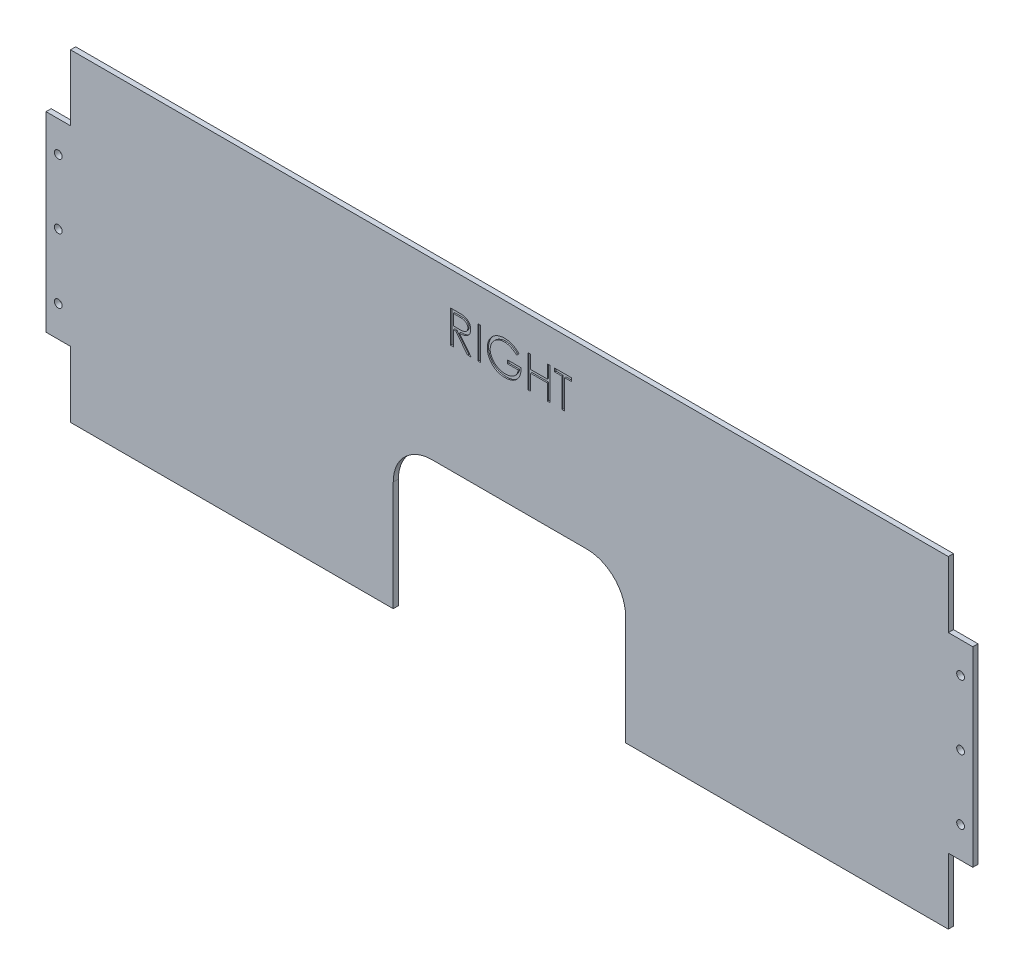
from build123d import *

# Parameters (mm, degrees)
BOSS_EXTRU_1_DEPTH      = 4
ESQUISSE2_R             = 3
ENL_V_MAT_EXTRU_1_DEPTH = 381.160492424
ESQUISSE3_W             = 180
ESQUISSE3_H             = 115
ENL_V_MAT_EXTRU_2_DEPTH = 381.160492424
CONG_1_R                = 30
ESQUISSE4_W             = 2.243589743
ESQUISSE4_H             = 25
ENL_V_MAT_EXTRU_3_DEPTH = 1


with BuildPart() as part:
    # Esquisse1 → Boss.-Extru.1 (new body)
    with BuildSketch(Plane.XY):
        Polygon((340, 125), (-340, 125), (-340, 74), (-359, 74), (-359, -74), (-340, -74), (-340, -125), (340, -125), (340, -74), (359, -74), (359, 74), (340, 74), align=None)
    extrude(amount=BOSS_EXTRU_1_DEPTH)

    # Esquisse2 → Enl_v. mat.-Extru.1 (cut, through all)
    with BuildSketch(Plane.XY.offset(4)):
        with Locations((-349.5, 50)):
            Circle(ESQUISSE2_R)
        with Locations((-349.5, -50)):
            Circle(ESQUISSE2_R)
        with Locations((-349.5, 0)):
            Circle(ESQUISSE2_R)
        with Locations(Location((349.5, 0, 0), (0, 0, 180))):
            Circle(ESQUISSE2_R)
        with Locations(Location((349.5, -50, 0), (0, 0, 180))):
            Circle(ESQUISSE2_R)
        with Locations(Location((349.5, 50, 0), (0, 0, 180))):
            Circle(ESQUISSE2_R)
    extrude(amount=-ENL_V_MAT_EXTRU_1_DEPTH, mode=Mode.SUBTRACT)

    # Esquisse3 → Enl_v. mat.-Extru.2 (cut, through all)
    with BuildSketch(Plane.XY.offset(4)):
        with Locations((0, -67.5)):
            Rectangle(ESQUISSE3_W, ESQUISSE3_H)
    extrude(amount=-ENL_V_MAT_EXTRU_2_DEPTH, mode=Mode.SUBTRACT)

    # Cong_1
    cong_1_edges = [part.edges().sort_by_distance(p)[0] for p in [
        (-90, -10, 2),
        (90, -10, 2),
    ]]
    fillet(cong_1_edges, radius=CONG_1_R)

    # Esquisse4 → Enl_v. mat.-Extru.3 (cut)
    # profile 1 of 5: a face of its own
    with BuildSketch(Plane.XY.offset(4)):
        with BuildLine():
            Line((-45.673076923, 99), (-40.670072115, 99))
            add(Edge.make_bspline(
                [(-40.670072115, 99), (-40.336206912, 98.998888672), (-39.695148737, 98.996754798), (-38.776768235, 98.984856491), (-37.942288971, 98.95075395), (-37.192147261, 98.921406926), (-36.526356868, 98.867893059), (-35.94287622, 98.81674558), (-35.444392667, 98.74979086), (-35.142636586, 98.687609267), (-35.006009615, 98.659455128)],
                knots=[0, 0, 0, 0, 1.410062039, 2.707475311, 3.878576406, 4.937260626, 5.877586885, 6.699081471, 7.410979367, 8, 8, 8, 8], degree=3))
            add(Edge.make_bspline(
                [(-35.006009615, 98.659455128), (-34.823105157, 98.614263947), (-34.46119809, 98.524845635), (-33.940126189, 98.335848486), (-33.443595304, 98.117136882), (-32.973667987, 97.860253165), (-32.53269805, 97.563290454), (-32.116138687, 97.231375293), (-31.722099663, 96.866323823), (-31.366516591, 96.458932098), (-31.03123765, 96.031528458), (-30.748461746, 95.569358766), (-30.504701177, 95.086062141), (-30.310626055, 94.576723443), (-30.154354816, 94.046282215), (-30.044167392, 93.489933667), (-29.978087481, 92.910212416), (-29.971359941, 92.514798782), (-29.967948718, 92.314302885)],
                knots=[0, 0, 0, 0, 1.027469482, 2.033020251, 3.019912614, 3.986113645, 4.951240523, 5.91722682, 6.890402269, 7.87763091, 8.8651537, 9.85103654, 10.82876324, 11.815024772, 12.821070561, 13.842952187, 14.906261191, 16, 16, 16, 16], degree=3))
            add(Edge.make_bspline(
                [(-29.967948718, 92.314302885), (-29.978441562, 91.981194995), (-29.998915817, 91.331215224), (-30.189809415, 90.387923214), (-30.502498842, 89.507999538), (-30.933379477, 88.692552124), (-31.482090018, 87.957476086), (-32.141552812, 87.311829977), (-32.912135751, 86.771544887), (-33.629488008, 86.396881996), (-34.263160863, 86.156932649), (-34.784827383, 85.988101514), (-35.353877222, 85.857658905), (-35.964858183, 85.740800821), (-36.620312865, 85.652574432), (-37.31867029, 85.5879559), (-38.060428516, 85.547569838), (-38.569993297, 85.541555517), (-38.83213141, 85.538461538)],
                knots=[0, 0, 0, 0, 1.260483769, 2.459530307, 3.627416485, 4.787058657, 5.939039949, 7.08810263, 8.267026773, 9.491475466, 10.141966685, 10.831826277, 11.566392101, 12.351337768, 13.187381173, 14.07005841, 15.007169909, 16, 16, 16, 16], degree=3))
            Line((-38.83213141, 85.538461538), (-29.647435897, 74))
            Line((-29.647435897, 74), (-32.421875, 74))
            Line((-32.421875, 74), (-41.606570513, 85.538461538))
            Line((-41.606570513, 85.538461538), (-43.429487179, 85.538461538))
            Line((-43.429487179, 85.538461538), (-43.429487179, 74))
            Line((-43.429487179, 74), (-45.673076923, 74))
            Line((-45.673076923, 74), (-45.673076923, 99))
        make_face()
        with BuildLine():
            Line((-43.429487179, 96.435897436), (-43.429487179, 88.102564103))
            Line((-43.429487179, 88.102564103), (-38.852163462, 88.067508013))
            add(Edge.make_bspline(
                [(-38.852163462, 88.067508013), (-38.638448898, 88.067413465), (-38.224209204, 88.067230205), (-37.624918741, 88.095757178), (-37.066917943, 88.128209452), (-36.552341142, 88.177847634), (-36.080958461, 88.241819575), (-35.65300551, 88.321840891), (-35.26778371, 88.41506991), (-34.818508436, 88.559367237), (-34.316818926, 88.787981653), (-33.771594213, 89.120592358), (-33.3072918, 89.538943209), (-32.915021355, 90.017325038), (-32.599811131, 90.543298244), (-32.377582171, 91.110558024), (-32.236564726, 91.704783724), (-32.219932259, 92.11319878), (-32.211538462, 92.319310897)],
                knots=[0, 0, 0, 0, 1.146690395, 2.22261258, 3.21895312, 4.145990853, 4.996080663, 5.770904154, 6.481378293, 7.121626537, 8.300444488, 9.431385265, 10.535395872, 11.636531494, 12.74115979, 13.810798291, 14.895190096, 16, 16, 16, 16], degree=3))
            add(Edge.make_bspline(
                [(-32.211538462, 92.319310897), (-32.220125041, 92.520357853), (-32.237140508, 92.918759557), (-32.376060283, 93.50201606), (-32.610984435, 94.052494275), (-32.927571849, 94.567954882), (-33.313280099, 95.035852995), (-33.765550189, 95.436189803), (-34.272015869, 95.766543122), (-34.745381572, 95.97764584), (-35.168483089, 96.107073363), (-35.535837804, 96.198153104), (-35.950919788, 96.271327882), (-36.415744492, 96.329956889), (-36.928327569, 96.380349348), (-37.491260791, 96.414290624), (-38.100809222, 96.434389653), (-38.523287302, 96.435383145), (-38.741987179, 96.435897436)],
                knots=[0, 0, 0, 0, 1.101028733, 2.181837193, 3.264309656, 4.369019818, 5.486613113, 6.575447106, 7.666700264, 8.788928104, 9.402425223, 10.0903467, 10.862060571, 11.710948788, 12.657782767, 13.684531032, 14.801375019, 16, 16, 16, 16], degree=3))
            Line((-38.741987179, 96.435897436), (-43.429487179, 96.435897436))
        make_face(mode=Mode.SUBTRACT)
    # profile 2 of 5: a face of its own
    with BuildSketch(Plane.XY.offset(4)):
        with Locations((-23.397435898, 86.5)):
            Rectangle(ESQUISSE4_W, ESQUISSE4_H)
    # profile 3 of 5: a face of its own
    with BuildSketch(Plane.XY.offset(4)):
        with BuildLine():
            Line((7.532051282, 94.733173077), (5.608974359, 92.91025641))
            add(Edge.make_bspline(
                [(5.608974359, 92.91025641), (5.260982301, 93.237619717), (4.573296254, 93.884540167), (3.452151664, 94.723904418), (2.282411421, 95.44294799), (1.070179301, 96.027992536), (-0.154524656, 96.494797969), (-1.375444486, 96.827141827), (-2.580056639, 97.039088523), (-3.381251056, 97.064434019), (-3.776041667, 97.076923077)],
                knots=[0, 0, 0, 0, 1.08915593, 2.152340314, 3.188132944, 4.216796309, 5.218260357, 6.173443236, 7.099959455, 8, 8, 8, 8], degree=3))
            add(Edge.make_bspline(
                [(-3.776041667, 97.076923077), (-4.018289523, 97.073968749), (-4.502156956, 97.068067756), (-5.220885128, 96.992751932), (-5.932075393, 96.884431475), (-6.634385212, 96.727703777), (-7.329180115, 96.529067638), (-8.014043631, 96.280600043), (-8.690253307, 95.990919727), (-9.351439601, 95.656187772), (-9.992443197, 95.288474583), (-10.597849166, 94.880985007), (-11.171516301, 94.446779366), (-11.702662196, 93.974986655), (-12.194342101, 93.469880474), (-12.658259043, 92.940856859), (-13.078096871, 92.373462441), (-13.457319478, 91.77813654), (-13.795616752, 91.165335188), (-14.094249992, 90.540956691), (-14.344943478, 89.907072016), (-14.543296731, 89.262885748), (-14.706944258, 88.613381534), (-14.822070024, 87.954062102), (-14.886975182, 87.284221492), (-14.898202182, 86.835669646), (-14.903846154, 86.610176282)],
                knots=[0, 0, 0, 0, 1.02818874, 2.053710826, 3.065248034, 4.081641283, 5.106893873, 6.131558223, 7.173050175, 8.228653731, 9.27666206, 10.308777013, 11.325269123, 12.329503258, 13.32196095, 14.316845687, 15.314881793, 16.315733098, 17.311955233, 18.285320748, 19.252783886, 20.203351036, 21.145449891, 22.095197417, 23.042428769, 24, 24, 24, 24], degree=3))
            add(Edge.make_bspline(
                [(-14.903846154, 86.610176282), (-14.898448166, 86.379670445), (-14.887666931, 85.919288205), (-14.818664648, 85.232187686), (-14.690605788, 84.555291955), (-14.519407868, 83.886376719), (-14.305259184, 83.224296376), (-14.038311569, 82.571921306), (-13.722128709, 81.929275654), (-13.356153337, 81.302149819), (-12.954823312, 80.691271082), (-12.505229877, 80.115845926), (-12.027654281, 79.568211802), (-11.504697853, 79.060527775), (-10.953129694, 78.57921423), (-10.35647058, 78.137531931), (-9.726453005, 77.726973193), (-9.062115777, 77.352712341), (-8.370667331, 77.018365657), (-7.661690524, 76.721052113), (-6.932920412, 76.476199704), (-6.188186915, 76.276641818), (-5.428377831, 76.113068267), (-4.649636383, 76.007836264), (-3.857688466, 75.931473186), (-3.323841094, 75.925889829), (-3.054887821, 75.923076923)],
                knots=[0, 0, 0, 0, 0.93586088, 1.869166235, 2.799637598, 3.729985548, 4.670839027, 5.622275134, 6.589130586, 7.576015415, 8.568469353, 9.55398029, 10.53834874, 11.515998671, 12.510579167, 13.508179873, 14.527009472, 15.561807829, 16.601455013, 17.643573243, 18.680854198, 19.719860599, 20.772568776, 21.833555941, 22.908541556, 24, 24, 24, 24], degree=3))
            add(Edge.make_bspline(
                [(-3.054887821, 75.923076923), (-2.730756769, 75.929852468), (-2.094272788, 75.943157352), (-1.15865534, 76.046730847), (-0.260061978, 76.208493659), (0.598982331, 76.445392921), (1.419475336, 76.747562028), (2.204424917, 77.111814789), (2.94765105, 77.552122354), (3.651388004, 78.049078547), (4.299653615, 78.602755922), (4.884325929, 79.200216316), (5.396079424, 79.838559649), (5.842541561, 80.514026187), (6.211889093, 81.232206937), (6.515051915, 81.989582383), (6.747432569, 82.786493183), (6.842825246, 83.337147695), (6.891025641, 83.615384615)],
                knots=[0, 0, 0, 0, 1.13008108, 2.219097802, 3.278683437, 4.311054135, 5.322181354, 6.324827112, 7.324222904, 8.330512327, 9.32562643, 10.293043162, 11.24128371, 12.174520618, 13.111833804, 14.052305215, 15.015860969, 16, 16, 16, 16], degree=3))
            Line((6.891025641, 83.615384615), (-1.442307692, 83.615384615))
            Line((-1.442307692, 83.615384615), (-1.442307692, 86.179487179))
            Line((-1.442307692, 86.179487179), (9.134615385, 86.179487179))
            add(Edge.make_bspline(
                [(9.134615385, 86.179487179), (9.122430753, 85.701576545), (9.098583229, 84.766219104), (8.93130526, 83.402145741), (8.661187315, 82.113776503), (8.292185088, 80.899754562), (7.814504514, 79.761800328), (7.233272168, 78.698758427), (6.539185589, 77.717496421), (5.75696815, 76.810003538), (4.879111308, 76.000509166), (3.929335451, 75.28903818), (2.906071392, 74.689733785), (1.810287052, 74.202157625), (0.645569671, 73.82162909), (-0.590775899, 73.551832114), (-1.897073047, 73.390189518), (-2.792335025, 73.369536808), (-3.250200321, 73.358974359)],
                knots=[0, 0, 0, 0, 1.140356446, 2.231883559, 3.274166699, 4.278491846, 5.25512956, 6.21435461, 7.1637429, 8.11826594, 9.068280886, 10.0076534, 10.945064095, 11.891975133, 12.864533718, 13.863980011, 14.907571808, 16, 16, 16, 16], degree=3))
            add(Edge.make_bspline(
                [(-3.250200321, 73.358974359), (-3.532415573, 73.363039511), (-4.089035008, 73.3710573), (-4.911113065, 73.428038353), (-5.710524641, 73.515756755), (-6.487153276, 73.648221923), (-7.24385572, 73.810469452), (-7.976852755, 74.018231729), (-8.688936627, 74.258722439), (-9.381207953, 74.532262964), (-10.047383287, 74.849203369), (-10.690429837, 75.201415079), (-11.313902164, 75.587081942), (-11.913553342, 76.012873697), (-12.492507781, 76.475605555), (-13.047032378, 76.976204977), (-13.580231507, 77.513141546), (-13.914234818, 77.894420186), (-14.082532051, 78.086538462)],
                knots=[0, 0, 0, 0, 1.107784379, 2.184907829, 3.233506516, 4.263428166, 5.276301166, 6.270063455, 7.25232949, 8.225834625, 9.190232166, 10.146266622, 11.1027726, 12.066435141, 13.031522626, 14.010570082, 14.99756817, 16, 16, 16, 16], degree=3))
            add(Edge.make_bspline(
                [(-14.082532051, 78.086538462), (-14.326717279, 78.39132884), (-14.811034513, 78.995850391), (-15.434449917, 79.964421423), (-15.965888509, 80.967291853), (-16.397087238, 82.007253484), (-16.733787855, 83.083333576), (-16.975261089, 84.194157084), (-17.116741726, 85.341154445), (-17.137124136, 86.117334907), (-17.147435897, 86.510016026)],
                knots=[0, 0, 0, 0, 1.023165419, 2.029347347, 3.013907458, 3.994755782, 4.975994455, 5.96558838, 6.970761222, 8, 8, 8, 8], degree=3))
            add(Edge.make_bspline(
                [(-17.147435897, 86.510016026), (-17.143634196, 86.804060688), (-17.136079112, 87.388412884), (-17.044468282, 88.25596508), (-16.913029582, 89.108112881), (-16.719836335, 89.944159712), (-16.476291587, 90.764663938), (-16.172338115, 91.570006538), (-15.818446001, 92.360662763), (-15.407121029, 93.131190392), (-14.94937489, 93.871364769), (-14.452587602, 94.578206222), (-13.909704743, 95.2388424), (-13.329591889, 95.861639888), (-12.705327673, 96.438774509), (-12.042760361, 96.975589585), (-11.341379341, 97.472805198), (-10.598978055, 97.922589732), (-9.826637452, 98.326615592), (-9.02620887, 98.680824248), (-8.19793665, 98.973562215), (-7.348026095, 99.221946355), (-6.470043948, 99.405625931), (-5.570361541, 99.538831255), (-4.644289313, 99.629978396), (-4.018317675, 99.637308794), (-3.700921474, 99.641025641)],
                knots=[0, 0, 0, 0, 1.008945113, 2.00506715, 2.99143336, 3.967273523, 4.948097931, 5.927297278, 6.919902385, 7.919676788, 8.923139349, 9.905703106, 10.883022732, 11.856032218, 12.825136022, 13.798837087, 14.781400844, 15.773989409, 16.776158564, 17.77167057, 18.775803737, 19.789618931, 20.80898985, 21.851988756, 22.910860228, 24, 24, 24, 24], degree=3))
            add(Edge.make_bspline(
                [(-3.700921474, 99.641025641), (-3.442076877, 99.636886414), (-2.928818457, 99.628678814), (-2.165063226, 99.571788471), (-1.413113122, 99.481617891), (-0.671853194, 99.358569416), (0.056192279, 99.190971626), (0.773097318, 98.99041245), (1.479901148, 98.756899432), (2.174388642, 98.478407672), (2.861229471, 98.162310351), (3.544242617, 97.806500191), (4.221094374, 97.404893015), (4.892958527, 96.956296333), (5.564071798, 96.468414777), (6.223819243, 95.927294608), (6.888125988, 95.354274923), (7.315281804, 94.942259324), (7.532051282, 94.733173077)],
                knots=[0, 0, 0, 0, 0.985871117, 1.954866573, 2.915460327, 3.869826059, 4.81536089, 5.759505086, 6.70452669, 7.649098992, 8.607881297, 9.583363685, 10.581137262, 11.603961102, 12.659522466, 13.73993555, 14.853081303, 16, 16, 16, 16], degree=3))
        make_face()
    # profile 4 of 5: a face of its own
    with BuildSketch(Plane.XY.offset(4)):
        Polygon((14.262820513, 99), (16.506410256, 99), (16.506410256, 88.743589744), (29.326923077, 88.743589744), (29.326923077, 99), (31.570512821, 99), (31.570512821, 74), (29.326923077, 74), (29.326923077, 86.179487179), (16.506410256, 86.179487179), (16.506410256, 74), (14.262820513, 74), align=None)
    # profile 5 of 5: a face of its own
    with BuildSketch(Plane.XY.offset(4)):
        Polygon((35.096153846, 96.435897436), (35.096153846, 99), (48.237179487, 99), (48.237179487, 96.435897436), (42.788461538, 96.435897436), (42.788461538, 74), (40.544871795, 74), (40.544871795, 96.435897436), align=None)
    extrude(amount=-ENL_V_MAT_EXTRU_3_DEPTH, mode=Mode.SUBTRACT)


solid = part.part
